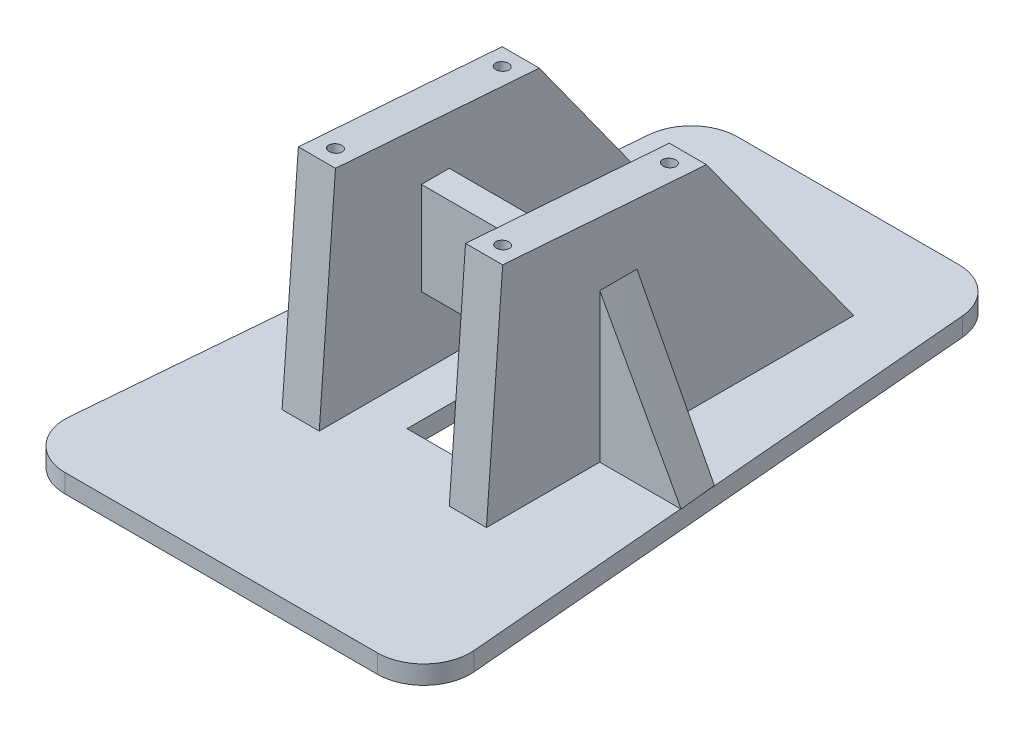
ISO-10303-21;
HEADER;
FILE_DESCRIPTION(('STEP AP214'),'2;1');
FILE_NAME('part.step','',(''),(''),'','','');
FILE_SCHEMA(('AUTOMOTIVE_DESIGN { 1 0 10303 214 1 1 1 1 }'));
ENDSEC;
DATA;
#1=APPLICATION_CONTEXT('core data for automotive mechanical design processes');
#2=APPLICATION_PROTOCOL_DEFINITION('international standard','automotive_design',2000,#1);
#3=PRODUCT_CONTEXT('',#1,'mechanical');
#4=PRODUCT('Part','Part','',(#3));
#5=PRODUCT_RELATED_PRODUCT_CATEGORY('part','',(#4));
#6=PRODUCT_DEFINITION_FORMATION('','',#4);
#7=PRODUCT_DEFINITION_CONTEXT('part definition',#1,'design');
#8=PRODUCT_DEFINITION('design','',#6,#7);
#9=PRODUCT_DEFINITION_SHAPE('','',#8);
#10=(LENGTH_UNIT() NAMED_UNIT(*) SI_UNIT(.MILLI.,.METRE.));
#11=(NAMED_UNIT(*) PLANE_ANGLE_UNIT() SI_UNIT($,.RADIAN.));
#12=(NAMED_UNIT(*) SI_UNIT($,.STERADIAN.) SOLID_ANGLE_UNIT());
#13=UNCERTAINTY_MEASURE_WITH_UNIT(LENGTH_MEASURE(1.E-05),#10,'distance_accuracy_value','');
#14=(GEOMETRIC_REPRESENTATION_CONTEXT(3) GLOBAL_UNCERTAINTY_ASSIGNED_CONTEXT((#13)) GLOBAL_UNIT_ASSIGNED_CONTEXT((#10,
#11,#12)) REPRESENTATION_CONTEXT('',''));
#15=CARTESIAN_POINT('',(0.,0.,0.));
#16=DIRECTION('',(0.,0.,1.));
#17=DIRECTION('',(1.,0.,0.));
#18=AXIS2_PLACEMENT_3D('',#15,#16,#17);
#19=CARTESIAN_POINT('',(0.,4.,0.));
#20=DIRECTION('',(0.,1.,0.));
#21=DIRECTION('',(1.,0.,0.));
#22=AXIS2_PLACEMENT_3D('',#19,#20,#21);
#23=PLANE('',#22);
#24=DIRECTION('',(1.,0.,0.));
#25=VECTOR('',#24,1.);
#26=CARTESIAN_POINT('',(-2.5,4.,-7.5));
#27=LINE('',#26,#25);
#28=CARTESIAN_POINT('',(-5.,4.,-7.5));
#29=VERTEX_POINT('',#28);
#30=CARTESIAN_POINT('',(5.,4.,-7.5));
#31=VERTEX_POINT('',#30);
#32=EDGE_CURVE('E649',#29,#31,#27,.T.);
#33=ORIENTED_EDGE('',*,*,#32,.T.);
#34=DIRECTION('',(0.,0.,1.));
#35=VECTOR('',#34,1.);
#36=CARTESIAN_POINT('',(5.,4.,-3.75));
#37=LINE('',#36,#35);
#38=CARTESIAN_POINT('',(5.,4.,22.5));
#39=VERTEX_POINT('',#38);
#40=EDGE_CURVE('E419',#31,#39,#37,.T.);
#41=ORIENTED_EDGE('',*,*,#40,.T.);
#42=DIRECTION('',(-1.,0.,0.));
#43=VECTOR('',#42,1.);
#44=CARTESIAN_POINT('',(2.5,4.,22.5));
#45=LINE('',#44,#43);
#46=CARTESIAN_POINT('',(-5.,4.,22.5));
#47=VERTEX_POINT('',#46);
#48=EDGE_CURVE('E420',#39,#47,#45,.T.);
#49=ORIENTED_EDGE('',*,*,#48,.T.);
#50=DIRECTION('',(0.,0.,-1.));
#51=VECTOR('',#50,1.);
#52=CARTESIAN_POINT('',(-5.,4.,11.25));
#53=LINE('',#52,#51);
#54=EDGE_CURVE('E408',#47,#29,#53,.T.);
#55=ORIENTED_EDGE('',*,*,#54,.T.);
#56=EDGE_LOOP('',(#33,#41,#49,#55));
#57=FACE_BOUND('',#56,.T.);
#58=DIRECTION('',(0.104587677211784,0.,0.994515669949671));
#59=VECTOR('',#58,1.);
#60=CARTESIAN_POINT('',(38.6776967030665,4.,0.));
#61=LINE('',#60,#59);
#62=CARTESIAN_POINT('',(38.6776967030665,4.,0.));
#63=VERTEX_POINT('',#62);
#64=CARTESIAN_POINT('',(39.0582783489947,4.,3.61891974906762));
#65=VERTEX_POINT('',#64);
#66=EDGE_CURVE('E532',#63,#65,#61,.T.);
#67=ORIENTED_EDGE('',*,*,#66,.T.);
#68=DIRECTION('',(-0.0848777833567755,0.,-0.996391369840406));
#69=VECTOR('',#68,1.);
#70=CARTESIAN_POINT('',(44.5,4.,67.5));
#71=LINE('',#70,#69);
#72=CARTESIAN_POINT('',(33.7795485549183,4.,-58.3487778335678));
#73=VERTEX_POINT('',#72);
#74=EDGE_CURVE('E28',#65,#73,#71,.T.);
#75=ORIENTED_EDGE('',*,*,#74,.T.);
#76=CARTESIAN_POINT('',(23.8156348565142,4.,-57.5));
#77=DIRECTION('',(0.,-1.,0.));
#78=DIRECTION('',(0.676432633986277,0.,-0.736504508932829));
#79=AXIS2_PLACEMENT_3D('',#76,#77,#78);
#80=CIRCLE('',#79,10.);
#81=CARTESIAN_POINT('',(23.8156348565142,4.,-67.5));
#82=VERTEX_POINT('',#81);
#83=EDGE_CURVE('E560',#82,#73,#80,.T.);
#84=ORIENTED_EDGE('',*,*,#83,.F.);
#85=DIRECTION('',(-1.,0.,0.));
#86=VECTOR('',#85,1.);
#87=CARTESIAN_POINT('',(33.,4.,-67.5));
#88=LINE('',#87,#86);
#89=CARTESIAN_POINT('',(-23.8156348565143,4.,-67.5));
#90=VERTEX_POINT('',#89);
#91=EDGE_CURVE('E604',#82,#90,#88,.T.);
#92=ORIENTED_EDGE('',*,*,#91,.T.);
#93=CARTESIAN_POINT('',(-23.8156348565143,4.,-57.5));
#94=DIRECTION('',(0.,-1.,0.));
#95=DIRECTION('',(-0.676432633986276,0.,-0.73650450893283));
#96=AXIS2_PLACEMENT_3D('',#93,#94,#95);
#97=CIRCLE('',#96,10.);
#98=CARTESIAN_POINT('',(-33.7795485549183,4.,-58.3487778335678));
#99=VERTEX_POINT('',#98);
#100=EDGE_CURVE('E449',#99,#90,#97,.T.);
#101=ORIENTED_EDGE('',*,*,#100,.F.);
#102=DIRECTION('',(-0.0848777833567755,0.,0.996391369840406));
#103=VECTOR('',#102,1.);
#104=CARTESIAN_POINT('',(-33.,4.,-67.5));
#105=LINE('',#104,#103);
#106=CARTESIAN_POINT('',(-39.0582783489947,4.,3.61891974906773));
#107=VERTEX_POINT('',#106);
#108=EDGE_CURVE('E544',#99,#107,#105,.T.);
#109=ORIENTED_EDGE('',*,*,#108,.T.);
#110=DIRECTION('',(0.104587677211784,0.,-0.994515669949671));
#111=VECTOR('',#110,1.);
#112=CARTESIAN_POINT('',(-38.6776967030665,4.,0.));
#113=LINE('',#112,#111);
#114=CARTESIAN_POINT('',(-38.6776967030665,4.,0.));
#115=VERTEX_POINT('',#114);
#116=EDGE_CURVE('E557',#107,#115,#113,.T.);
#117=ORIENTED_EDGE('',*,*,#116,.T.);
#118=DIRECTION('',(1.,0.,0.));
#119=VECTOR('',#118,1.);
#120=CARTESIAN_POINT('',(-13.5953688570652,4.,0.));
#121=LINE('',#120,#119);
#122=CARTESIAN_POINT('',(-22.,4.,0.));
#123=VERTEX_POINT('',#122);
#124=EDGE_CURVE('E553',#115,#123,#121,.T.);
#125=ORIENTED_EDGE('',*,*,#124,.T.);
#126=DIRECTION('',(0.,0.,-1.));
#127=VECTOR('',#126,1.);
#128=CARTESIAN_POINT('',(-22.,4.,-7.48785926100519));
#129=LINE('',#128,#127);
#130=CARTESIAN_POINT('',(-22.,4.,-46.6672508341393));
#131=VERTEX_POINT('',#130);
#132=EDGE_CURVE('E425',#123,#131,#129,.T.);
#133=ORIENTED_EDGE('',*,*,#132,.T.);
#134=DIRECTION('',(1.,0.,0.));
#135=VECTOR('',#134,1.);
#136=CARTESIAN_POINT('',(-11.,4.,-46.6672508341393));
#137=LINE('',#136,#135);
#138=CARTESIAN_POINT('',(-14.,4.,-46.6672508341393));
#139=VERTEX_POINT('',#138);
#140=EDGE_CURVE('E736',#131,#139,#137,.T.);
#141=ORIENTED_EDGE('',*,*,#140,.T.);
#142=DIRECTION('',(0.,0.,1.));
#143=VECTOR('',#142,1.);
#144=CARTESIAN_POINT('',(-14.,4.,14.4520313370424));
#145=LINE('',#144,#143);
#146=CARTESIAN_POINT('',(-14.,4.,32.4041094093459));
#147=VERTEX_POINT('',#146);
#148=EDGE_CURVE('E636',#139,#147,#145,.T.);
#149=ORIENTED_EDGE('',*,*,#148,.T.);
#150=DIRECTION('',(-1.,0.,0.));
#151=VECTOR('',#150,1.);
#152=CARTESIAN_POINT('',(-11.,4.,32.4041094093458));
#153=LINE('',#152,#151);
#154=CARTESIAN_POINT('',(-22.,4.,32.4041094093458));
#155=VERTEX_POINT('',#154);
#156=EDGE_CURVE('E421',#147,#155,#153,.T.);
#157=ORIENTED_EDGE('',*,*,#156,.T.);
#158=DIRECTION('',(0.,0.,-1.));
#159=VECTOR('',#158,1.);
#160=CARTESIAN_POINT('',(-22.,4.,-7.48785926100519));
#161=LINE('',#160,#159);
#162=CARTESIAN_POINT('',(-22.,4.,8.));
#163=VERTEX_POINT('',#162);
#164=EDGE_CURVE('E509',#155,#163,#161,.T.);
#165=ORIENTED_EDGE('',*,*,#164,.T.);
#166=DIRECTION('',(-1.,0.,0.));
#167=VECTOR('',#166,1.);
#168=CARTESIAN_POINT('',(-13.7500913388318,4.,8.));
#169=LINE('',#168,#167);
#170=CARTESIAN_POINT('',(-39.4314814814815,4.,8.));
#171=VERTEX_POINT('',#170);
#172=EDGE_CURVE('E402',#163,#171,#169,.T.);
#173=ORIENTED_EDGE('',*,*,#172,.T.);
#174=DIRECTION('',(-0.0848777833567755,0.,0.996391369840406));
#175=VECTOR('',#174,1.);
#176=CARTESIAN_POINT('',(-33.,4.,-67.5));
#177=LINE('',#176,#175);
#178=CARTESIAN_POINT('',(-43.5758448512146,4.,56.6512221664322));
#179=VERTEX_POINT('',#178);
#180=EDGE_CURVE('E289',#171,#179,#177,.T.);
#181=ORIENTED_EDGE('',*,*,#180,.T.);
#182=CARTESIAN_POINT('',(-33.6119311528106,4.,57.5));
#183=DIRECTION('',(0.,-1.,0.));
#184=DIRECTION('',(-0.73650450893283,0.,0.676432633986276));
#185=AXIS2_PLACEMENT_3D('',#182,#183,#184);
#186=CIRCLE('',#185,10.);
#187=CARTESIAN_POINT('',(-33.6119311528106,4.,67.5));
#188=VERTEX_POINT('',#187);
#189=EDGE_CURVE('E411',#188,#179,#186,.T.);
#190=ORIENTED_EDGE('',*,*,#189,.F.);
#191=DIRECTION('',(1.,0.,0.));
#192=VECTOR('',#191,1.);
#193=CARTESIAN_POINT('',(-44.5,4.,67.5));
#194=LINE('',#193,#192);
#195=CARTESIAN_POINT('',(33.6119311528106,4.,67.5));
#196=VERTEX_POINT('',#195);
#197=EDGE_CURVE('E454',#188,#196,#194,.T.);
#198=ORIENTED_EDGE('',*,*,#197,.T.);
#199=CARTESIAN_POINT('',(33.6119311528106,4.,57.5));
#200=DIRECTION('',(0.,-1.,0.));
#201=DIRECTION('',(0.736504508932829,0.,0.676432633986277));
#202=AXIS2_PLACEMENT_3D('',#199,#200,#201);
#203=CIRCLE('',#202,10.);
#204=CARTESIAN_POINT('',(43.5758448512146,4.,56.6512221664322));
#205=VERTEX_POINT('',#204);
#206=EDGE_CURVE('E277',#205,#196,#203,.T.);
#207=ORIENTED_EDGE('',*,*,#206,.F.);
#208=DIRECTION('',(-0.0848777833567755,0.,-0.996391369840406));
#209=VECTOR('',#208,1.);
#210=CARTESIAN_POINT('',(44.5,4.,67.5));
#211=LINE('',#210,#209);
#212=CARTESIAN_POINT('',(39.4314814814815,4.,8.));
#213=VERTEX_POINT('',#212);
#214=EDGE_CURVE('E11',#205,#213,#211,.T.);
#215=ORIENTED_EDGE('',*,*,#214,.T.);
#216=DIRECTION('',(-1.,0.,0.));
#217=VECTOR('',#216,1.);
#218=CARTESIAN_POINT('',(13.7500913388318,4.,8.));
#219=LINE('',#218,#217);
#220=CARTESIAN_POINT('',(22.,4.,8.));
#221=VERTEX_POINT('',#220);
#222=EDGE_CURVE('E536',#213,#221,#219,.T.);
#223=ORIENTED_EDGE('',*,*,#222,.T.);
#224=DIRECTION('',(0.,0.,1.));
#225=VECTOR('',#224,1.);
#226=CARTESIAN_POINT('',(22.,4.,-14.5959223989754));
#227=LINE('',#226,#225);
#228=CARTESIAN_POINT('',(22.,4.,32.4041094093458));
#229=VERTEX_POINT('',#228);
#230=EDGE_CURVE('E379',#221,#229,#227,.T.);
#231=ORIENTED_EDGE('',*,*,#230,.T.);
#232=DIRECTION('',(-1.,0.,0.));
#233=VECTOR('',#232,1.);
#234=CARTESIAN_POINT('',(11.,4.,32.4041094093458));
#235=LINE('',#234,#233);
#236=CARTESIAN_POINT('',(14.,4.,32.4041094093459));
#237=VERTEX_POINT('',#236);
#238=EDGE_CURVE('E370',#229,#237,#235,.T.);
#239=ORIENTED_EDGE('',*,*,#238,.T.);
#240=DIRECTION('',(0.,0.,-1.));
#241=VECTOR('',#240,1.);
#242=CARTESIAN_POINT('',(14.,4.,-14.5959223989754));
#243=LINE('',#242,#241);
#244=CARTESIAN_POINT('',(14.,4.,-46.6672508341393));
#245=VERTEX_POINT('',#244);
#246=EDGE_CURVE('E433',#237,#245,#243,.T.);
#247=ORIENTED_EDGE('',*,*,#246,.T.);
#248=DIRECTION('',(1.,0.,0.));
#249=VECTOR('',#248,1.);
#250=CARTESIAN_POINT('',(11.,4.,-46.6672508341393));
#251=LINE('',#250,#249);
#252=CARTESIAN_POINT('',(22.,4.,-46.6672508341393));
#253=VERTEX_POINT('',#252);
#254=EDGE_CURVE('E460',#245,#253,#251,.T.);
#255=ORIENTED_EDGE('',*,*,#254,.T.);
#256=DIRECTION('',(0.,0.,1.));
#257=VECTOR('',#256,1.);
#258=CARTESIAN_POINT('',(22.,4.,-14.5959223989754));
#259=LINE('',#258,#257);
#260=CARTESIAN_POINT('',(22.,4.,0.));
#261=VERTEX_POINT('',#260);
#262=EDGE_CURVE('E392',#253,#261,#259,.T.);
#263=ORIENTED_EDGE('',*,*,#262,.T.);
#264=DIRECTION('',(1.,0.,0.));
#265=VECTOR('',#264,1.);
#266=CARTESIAN_POINT('',(13.5953688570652,4.,0.));
#267=LINE('',#266,#265);
#268=EDGE_CURVE('E429',#261,#63,#267,.T.);
#269=ORIENTED_EDGE('',*,*,#268,.T.);
#270=EDGE_LOOP('',(#67,#75,#84,#92,#101,#109,#117,#125,#133,#141,#149,#157,#165,#173,#181,#190,
#198,#207,#215,#223,#231,#239,#247,#255,#263,#269));
#271=FACE_BOUND('',#270,.T.);
#272=ADVANCED_FACE('F17',(#57,#271),#23,.T.);
#273=CARTESIAN_POINT('',(44.5,0.,67.5));
#274=DIRECTION('',(0.996391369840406,0.,-0.0848777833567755));
#275=DIRECTION('',(0.,-1.,0.));
#276=AXIS2_PLACEMENT_3D('',#273,#274,#275);
#277=PLANE('',#276);
#278=DIRECTION('',(0.,-1.,0.));
#279=VECTOR('',#278,1.);
#280=CARTESIAN_POINT('',(33.7795485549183,0.,-58.3487778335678));
#281=LINE('',#280,#279);
#282=CARTESIAN_POINT('',(33.7795485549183,0.,-58.3487778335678));
#283=VERTEX_POINT('',#282);
#284=EDGE_CURVE('E541',#73,#283,#281,.T.);
#285=ORIENTED_EDGE('',*,*,#284,.F.);
#286=ORIENTED_EDGE('',*,*,#74,.F.);
#287=DIRECTION('',(-0.0848777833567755,0.,-0.996391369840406));
#288=VECTOR('',#287,1.);
#289=CARTESIAN_POINT('',(44.5,4.,67.5));
#290=LINE('',#289,#288);
#291=EDGE_CURVE('E415',#213,#65,#290,.T.);
#292=ORIENTED_EDGE('',*,*,#291,.F.);
#293=ORIENTED_EDGE('',*,*,#214,.F.);
#294=DIRECTION('',(0.,1.,0.));
#295=VECTOR('',#294,1.);
#296=CARTESIAN_POINT('',(43.5758448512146,0.,56.6512221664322));
#297=LINE('',#296,#295);
#298=CARTESIAN_POINT('',(43.5758448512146,0.,56.6512221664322));
#299=VERTEX_POINT('',#298);
#300=EDGE_CURVE('E540',#299,#205,#297,.T.);
#301=ORIENTED_EDGE('',*,*,#300,.F.);
#302=DIRECTION('',(-0.0848777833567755,0.,-0.996391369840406));
#303=VECTOR('',#302,1.);
#304=CARTESIAN_POINT('',(44.5,0.,67.5));
#305=LINE('',#304,#303);
#306=EDGE_CURVE('E655',#299,#283,#305,.T.);
#307=ORIENTED_EDGE('',*,*,#306,.T.);
#308=EDGE_LOOP('',(#285,#286,#292,#293,#301,#307));
#309=FACE_BOUND('',#308,.T.);
#310=ADVANCED_FACE('F912',(#309),#277,.T.);
#311=CARTESIAN_POINT('',(-33.,0.,-67.5));
#312=DIRECTION('',(-0.996391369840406,0.,-0.0848777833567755));
#313=DIRECTION('',(-0.0848777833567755,0.,0.996391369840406));
#314=AXIS2_PLACEMENT_3D('',#311,#312,#313);
#315=PLANE('',#314);
#316=DIRECTION('',(0.,-1.,0.));
#317=VECTOR('',#316,1.);
#318=CARTESIAN_POINT('',(-43.5758448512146,0.,56.6512221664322));
#319=LINE('',#318,#317);
#320=CARTESIAN_POINT('',(-43.5758448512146,0.,56.6512221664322));
#321=VERTEX_POINT('',#320);
#322=EDGE_CURVE('E704',#179,#321,#319,.T.);
#323=ORIENTED_EDGE('',*,*,#322,.F.);
#324=ORIENTED_EDGE('',*,*,#180,.F.);
#325=DIRECTION('',(-0.0848777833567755,0.,0.996391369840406));
#326=VECTOR('',#325,1.);
#327=CARTESIAN_POINT('',(-33.,4.,-67.5));
#328=LINE('',#327,#326);
#329=EDGE_CURVE('E680',#107,#171,#328,.T.);
#330=ORIENTED_EDGE('',*,*,#329,.F.);
#331=ORIENTED_EDGE('',*,*,#108,.F.);
#332=DIRECTION('',(0.,1.,0.));
#333=VECTOR('',#332,1.);
#334=CARTESIAN_POINT('',(-33.7795485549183,0.,-58.3487778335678));
#335=LINE('',#334,#333);
#336=CARTESIAN_POINT('',(-33.7795485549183,0.,-58.3487778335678));
#337=VERTEX_POINT('',#336);
#338=EDGE_CURVE('E396',#337,#99,#335,.T.);
#339=ORIENTED_EDGE('',*,*,#338,.F.);
#340=DIRECTION('',(-0.0848777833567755,0.,0.996391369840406));
#341=VECTOR('',#340,1.);
#342=CARTESIAN_POINT('',(-33.,0.,-67.5));
#343=LINE('',#342,#341);
#344=EDGE_CURVE('E489',#337,#321,#343,.T.);
#345=ORIENTED_EDGE('',*,*,#344,.T.);
#346=EDGE_LOOP('',(#323,#324,#330,#331,#339,#345));
#347=FACE_BOUND('',#346,.T.);
#348=ADVANCED_FACE('F803',(#347),#315,.T.);
#349=CARTESIAN_POINT('',(33.6119311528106,0.,57.5));
#350=DIRECTION('',(0.,1.,0.));
#351=DIRECTION('',(0.736504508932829,0.,0.676432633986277));
#352=AXIS2_PLACEMENT_3D('',#349,#350,#351);
#353=CYLINDRICAL_SURFACE('',#352,10.);
#354=ORIENTED_EDGE('',*,*,#206,.T.);
#355=DIRECTION('',(0.,-1.,0.));
#356=VECTOR('',#355,1.);
#357=CARTESIAN_POINT('',(33.6119311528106,0.,67.5));
#358=LINE('',#357,#356);
#359=CARTESIAN_POINT('',(33.6119311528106,0.,67.5));
#360=VERTEX_POINT('',#359);
#361=EDGE_CURVE('E497',#196,#360,#358,.T.);
#362=ORIENTED_EDGE('',*,*,#361,.T.);
#363=CARTESIAN_POINT('',(33.6119311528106,0.,57.5));
#364=DIRECTION('',(0.,1.,0.));
#365=DIRECTION('',(0.736504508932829,0.,0.676432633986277));
#366=AXIS2_PLACEMENT_3D('',#363,#364,#365);
#367=CIRCLE('',#366,10.);
#368=EDGE_CURVE('E503',#360,#299,#367,.T.);
#369=ORIENTED_EDGE('',*,*,#368,.T.);
#370=ORIENTED_EDGE('',*,*,#300,.T.);
#371=EDGE_LOOP('',(#354,#362,#369,#370));
#372=FACE_BOUND('',#371,.T.);
#373=ADVANCED_FACE('F913',(#372),#353,.T.);
#374=CARTESIAN_POINT('',(23.8156348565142,0.,-57.5));
#375=DIRECTION('',(0.,1.,0.));
#376=DIRECTION('',(0.676432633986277,0.,-0.736504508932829));
#377=AXIS2_PLACEMENT_3D('',#374,#375,#376);
#378=CYLINDRICAL_SURFACE('',#377,10.);
#379=ORIENTED_EDGE('',*,*,#83,.T.);
#380=ORIENTED_EDGE('',*,*,#284,.T.);
#381=CARTESIAN_POINT('',(23.8156348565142,0.,-57.5));
#382=DIRECTION('',(0.,1.,0.));
#383=DIRECTION('',(0.676432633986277,0.,-0.736504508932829));
#384=AXIS2_PLACEMENT_3D('',#381,#382,#383);
#385=CIRCLE('',#384,10.);
#386=CARTESIAN_POINT('',(23.8156348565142,0.,-67.5));
#387=VERTEX_POINT('',#386);
#388=EDGE_CURVE('E740',#283,#387,#385,.T.);
#389=ORIENTED_EDGE('',*,*,#388,.T.);
#390=DIRECTION('',(0.,1.,0.));
#391=VECTOR('',#390,1.);
#392=CARTESIAN_POINT('',(23.8156348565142,0.,-67.5));
#393=LINE('',#392,#391);
#394=EDGE_CURVE('E600',#387,#82,#393,.T.);
#395=ORIENTED_EDGE('',*,*,#394,.T.);
#396=EDGE_LOOP('',(#379,#380,#389,#395));
#397=FACE_BOUND('',#396,.T.);
#398=ADVANCED_FACE('F910',(#397),#378,.T.);
#399=CARTESIAN_POINT('',(33.,0.,-67.5));
#400=DIRECTION('',(0.,0.,-1.));
#401=DIRECTION('',(0.,-1.,0.));
#402=AXIS2_PLACEMENT_3D('',#399,#400,#401);
#403=PLANE('',#402);
#404=DIRECTION('',(0.,-1.,0.));
#405=VECTOR('',#404,1.);
#406=CARTESIAN_POINT('',(-23.8156348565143,0.,-67.5));
#407=LINE('',#406,#405);
#408=CARTESIAN_POINT('',(-23.8156348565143,0.,-67.5));
#409=VERTEX_POINT('',#408);
#410=EDGE_CURVE('E453',#90,#409,#407,.T.);
#411=ORIENTED_EDGE('',*,*,#410,.F.);
#412=ORIENTED_EDGE('',*,*,#91,.F.);
#413=ORIENTED_EDGE('',*,*,#394,.F.);
#414=DIRECTION('',(-1.,0.,0.));
#415=VECTOR('',#414,1.);
#416=CARTESIAN_POINT('',(33.,0.,-67.5));
#417=LINE('',#416,#415);
#418=EDGE_CURVE('E549',#387,#409,#417,.T.);
#419=ORIENTED_EDGE('',*,*,#418,.T.);
#420=EDGE_LOOP('',(#411,#412,#413,#419));
#421=FACE_BOUND('',#420,.T.);
#422=ADVANCED_FACE('F907',(#421),#403,.T.);
#423=CARTESIAN_POINT('',(-23.8156348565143,0.,-57.5));
#424=DIRECTION('',(0.,1.,0.));
#425=DIRECTION('',(-0.676432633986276,0.,-0.73650450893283));
#426=AXIS2_PLACEMENT_3D('',#423,#424,#425);
#427=CYLINDRICAL_SURFACE('',#426,10.);
#428=ORIENTED_EDGE('',*,*,#100,.T.);
#429=ORIENTED_EDGE('',*,*,#410,.T.);
#430=CARTESIAN_POINT('',(-23.8156348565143,0.,-57.5));
#431=DIRECTION('',(0.,1.,0.));
#432=DIRECTION('',(-0.676432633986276,0.,-0.73650450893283));
#433=AXIS2_PLACEMENT_3D('',#430,#431,#432);
#434=CIRCLE('',#433,10.);
#435=EDGE_CURVE('E545',#409,#337,#434,.T.);
#436=ORIENTED_EDGE('',*,*,#435,.T.);
#437=ORIENTED_EDGE('',*,*,#338,.T.);
#438=EDGE_LOOP('',(#428,#429,#436,#437));
#439=FACE_BOUND('',#438,.T.);
#440=ADVANCED_FACE('F19',(#439),#427,.T.);
#441=CARTESIAN_POINT('',(-44.5,0.,67.5));
#442=DIRECTION('',(0.,0.,1.));
#443=DIRECTION('',(1.,0.,0.));
#444=AXIS2_PLACEMENT_3D('',#441,#442,#443);
#445=PLANE('',#444);
#446=DIRECTION('',(0.,1.,0.));
#447=VECTOR('',#446,1.);
#448=CARTESIAN_POINT('',(-33.6119311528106,0.,67.5));
#449=LINE('',#448,#447);
#450=CARTESIAN_POINT('',(-33.6119311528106,0.,67.5));
#451=VERTEX_POINT('',#450);
#452=EDGE_CURVE('E527',#451,#188,#449,.T.);
#453=ORIENTED_EDGE('',*,*,#452,.F.);
#454=DIRECTION('',(1.,0.,0.));
#455=VECTOR('',#454,1.);
#456=CARTESIAN_POINT('',(-44.5,0.,67.5));
#457=LINE('',#456,#455);
#458=EDGE_CURVE('E498',#451,#360,#457,.T.);
#459=ORIENTED_EDGE('',*,*,#458,.T.);
#460=ORIENTED_EDGE('',*,*,#361,.F.);
#461=ORIENTED_EDGE('',*,*,#197,.F.);
#462=EDGE_LOOP('',(#453,#459,#460,#461));
#463=FACE_BOUND('',#462,.T.);
#464=ADVANCED_FACE('F916',(#463),#445,.T.);
#465=CARTESIAN_POINT('',(-33.6119311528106,0.,57.5));
#466=DIRECTION('',(0.,1.,0.));
#467=DIRECTION('',(-0.73650450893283,0.,0.676432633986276));
#468=AXIS2_PLACEMENT_3D('',#465,#466,#467);
#469=CYLINDRICAL_SURFACE('',#468,10.);
#470=ORIENTED_EDGE('',*,*,#189,.T.);
#471=ORIENTED_EDGE('',*,*,#322,.T.);
#472=CARTESIAN_POINT('',(-33.6119311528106,0.,57.5));
#473=DIRECTION('',(0.,1.,0.));
#474=DIRECTION('',(-0.73650450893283,0.,0.676432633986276));
#475=AXIS2_PLACEMENT_3D('',#472,#473,#474);
#476=CIRCLE('',#475,10.);
#477=EDGE_CURVE('E432',#321,#451,#476,.T.);
#478=ORIENTED_EDGE('',*,*,#477,.T.);
#479=ORIENTED_EDGE('',*,*,#452,.T.);
#480=EDGE_LOOP('',(#470,#471,#478,#479));
#481=FACE_BOUND('',#480,.T.);
#482=ADVANCED_FACE('F799',(#481),#469,.T.);
#483=CARTESIAN_POINT('',(-5.,4.,22.5));
#484=DIRECTION('',(-1.,0.,0.));
#485=DIRECTION('',(0.,1.,0.));
#486=AXIS2_PLACEMENT_3D('',#483,#484,#485);
#487=PLANE('',#486);
#488=DIRECTION('',(0.,0.,1.));
#489=VECTOR('',#488,1.);
#490=CARTESIAN_POINT('',(-5.,0.,11.25));
#491=LINE('',#490,#489);
#492=CARTESIAN_POINT('',(-5.,0.,-7.5));
#493=VERTEX_POINT('',#492);
#494=CARTESIAN_POINT('',(-5.,0.,22.5));
#495=VERTEX_POINT('',#494);
#496=EDGE_CURVE('E620',#493,#495,#491,.T.);
#497=ORIENTED_EDGE('',*,*,#496,.F.);
#498=DIRECTION('',(0.,-1.,0.));
#499=VECTOR('',#498,1.);
#500=CARTESIAN_POINT('',(-5.,4.,-7.5));
#501=LINE('',#500,#499);
#502=EDGE_CURVE('E412',#29,#493,#501,.T.);
#503=ORIENTED_EDGE('',*,*,#502,.F.);
#504=ORIENTED_EDGE('',*,*,#54,.F.);
#505=DIRECTION('',(0.,-1.,0.));
#506=VECTOR('',#505,1.);
#507=CARTESIAN_POINT('',(-5.,4.,22.5));
#508=LINE('',#507,#506);
#509=EDGE_CURVE('E579',#47,#495,#508,.T.);
#510=ORIENTED_EDGE('',*,*,#509,.T.);
#511=EDGE_LOOP('',(#497,#503,#504,#510));
#512=FACE_BOUND('',#511,.T.);
#513=ADVANCED_FACE('F777',(#512),#487,.F.);
#514=CARTESIAN_POINT('',(-5.,4.,-7.5));
#515=DIRECTION('',(0.,0.,-1.));
#516=DIRECTION('',(-1.,0.,0.));
#517=AXIS2_PLACEMENT_3D('',#514,#515,#516);
#518=PLANE('',#517);
#519=DIRECTION('',(-1.,0.,0.));
#520=VECTOR('',#519,1.);
#521=CARTESIAN_POINT('',(-2.5,0.,-7.5));
#522=LINE('',#521,#520);
#523=CARTESIAN_POINT('',(5.,0.,-7.5));
#524=VERTEX_POINT('',#523);
#525=EDGE_CURVE('E502',#524,#493,#522,.T.);
#526=ORIENTED_EDGE('',*,*,#525,.F.);
#527=DIRECTION('',(0.,-1.,0.));
#528=VECTOR('',#527,1.);
#529=CARTESIAN_POINT('',(5.,4.,-7.5));
#530=LINE('',#529,#528);
#531=EDGE_CURVE('E21',#31,#524,#530,.T.);
#532=ORIENTED_EDGE('',*,*,#531,.F.);
#533=ORIENTED_EDGE('',*,*,#32,.F.);
#534=ORIENTED_EDGE('',*,*,#502,.T.);
#535=EDGE_LOOP('',(#526,#532,#533,#534));
#536=FACE_BOUND('',#535,.T.);
#537=ADVANCED_FACE('F782',(#536),#518,.F.);
#538=CARTESIAN_POINT('',(5.,4.,-7.5));
#539=DIRECTION('',(1.,0.,0.));
#540=DIRECTION('',(0.,0.,-1.));
#541=AXIS2_PLACEMENT_3D('',#538,#539,#540);
#542=PLANE('',#541);
#543=DIRECTION('',(0.,0.,-1.));
#544=VECTOR('',#543,1.);
#545=CARTESIAN_POINT('',(5.,0.,-3.75));
#546=LINE('',#545,#544);
#547=CARTESIAN_POINT('',(5.,0.,22.5));
#548=VERTEX_POINT('',#547);
#549=EDGE_CURVE('E575',#548,#524,#546,.T.);
#550=ORIENTED_EDGE('',*,*,#549,.F.);
#551=DIRECTION('',(0.,-1.,0.));
#552=VECTOR('',#551,1.);
#553=CARTESIAN_POINT('',(5.,4.,22.5));
#554=LINE('',#553,#552);
#555=EDGE_CURVE('E416',#39,#548,#554,.T.);
#556=ORIENTED_EDGE('',*,*,#555,.F.);
#557=ORIENTED_EDGE('',*,*,#40,.F.);
#558=ORIENTED_EDGE('',*,*,#531,.T.);
#559=EDGE_LOOP('',(#550,#556,#557,#558));
#560=FACE_BOUND('',#559,.T.);
#561=ADVANCED_FACE('F785',(#560),#542,.F.);
#562=CARTESIAN_POINT('',(5.,4.,22.5));
#563=DIRECTION('',(0.,0.,1.));
#564=DIRECTION('',(1.,0.,0.));
#565=AXIS2_PLACEMENT_3D('',#562,#563,#564);
#566=PLANE('',#565);
#567=DIRECTION('',(1.,0.,0.));
#568=VECTOR('',#567,1.);
#569=CARTESIAN_POINT('',(2.5,0.,22.5));
#570=LINE('',#569,#568);
#571=EDGE_CURVE('E580',#495,#548,#570,.T.);
#572=ORIENTED_EDGE('',*,*,#571,.F.);
#573=ORIENTED_EDGE('',*,*,#509,.F.);
#574=ORIENTED_EDGE('',*,*,#48,.F.);
#575=ORIENTED_EDGE('',*,*,#555,.T.);
#576=EDGE_LOOP('',(#572,#573,#574,#575));
#577=FACE_BOUND('',#576,.T.);
#578=ADVANCED_FACE('F774',(#577),#566,.F.);
#579=CARTESIAN_POINT('',(0.,0.,0.));
#580=DIRECTION('',(0.,1.,0.));
#581=DIRECTION('',(1.,0.,0.));
#582=AXIS2_PLACEMENT_3D('',#579,#580,#581);
#583=PLANE('',#582);
#584=ORIENTED_EDGE('',*,*,#525,.T.);
#585=ORIENTED_EDGE('',*,*,#496,.T.);
#586=ORIENTED_EDGE('',*,*,#571,.T.);
#587=ORIENTED_EDGE('',*,*,#549,.T.);
#588=EDGE_LOOP('',(#584,#585,#586,#587));
#589=FACE_BOUND('',#588,.T.);
#590=ORIENTED_EDGE('',*,*,#477,.F.);
#591=ORIENTED_EDGE('',*,*,#344,.F.);
#592=ORIENTED_EDGE('',*,*,#435,.F.);
#593=ORIENTED_EDGE('',*,*,#418,.F.);
#594=ORIENTED_EDGE('',*,*,#388,.F.);
#595=ORIENTED_EDGE('',*,*,#306,.F.);
#596=ORIENTED_EDGE('',*,*,#368,.F.);
#597=ORIENTED_EDGE('',*,*,#458,.F.);
#598=EDGE_LOOP('',(#590,#591,#592,#593,#594,#595,#596,#597));
#599=FACE_BOUND('',#598,.T.);
#600=ADVANCED_FACE('F787',(#589,#599),#583,.F.);
#601=CARTESIAN_POINT('',(18.,49.6254538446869,6.96417207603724));
#602=DIRECTION('',(0.,0.997267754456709,-0.0738716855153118));
#603=DIRECTION('',(-1.,0.,0.));
#604=AXIS2_PLACEMENT_3D('',#601,#602,#603);
#605=PLANE('',#604);
#606=CARTESIAN_POINT('',(18.,48.2957635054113,-10.9866475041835));
#607=DIRECTION('',(0.,-0.997267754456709,0.0738716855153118));
#608=DIRECTION('',(1.,0.,0.));
#609=AXIS2_PLACEMENT_3D('',#606,#607,#608);
#610=CIRCLE('',#609,1.375);
#611=CARTESIAN_POINT('',(19.375,48.2957635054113,-10.9866475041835));
#612=VERTEX_POINT('',#611);
#613=CARTESIAN_POINT('',(16.625,48.2957635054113,-10.9866475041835));
#614=VERTEX_POINT('',#613);
#615=EDGE_CURVE('E494',#612,#614,#610,.T.);
#616=ORIENTED_EDGE('',*,*,#615,.T.);
#617=CARTESIAN_POINT('',(18.,48.2957635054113,-10.9866475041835));
#618=DIRECTION('',(0.,-0.997267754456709,0.0738716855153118));
#619=DIRECTION('',(1.,0.,0.));
#620=AXIS2_PLACEMENT_3D('',#617,#618,#619);
#621=CIRCLE('',#620,1.375);
#622=EDGE_CURVE('E490',#614,#612,#621,.T.);
#623=ORIENTED_EDGE('',*,*,#622,.T.);
#624=EDGE_LOOP('',(#616,#623));
#625=FACE_BOUND('',#624,.T.);
#626=CARTESIAN_POINT('',(18.,50.9551441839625,24.914991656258));
#627=DIRECTION('',(0.,-0.997267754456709,0.0738716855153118));
#628=DIRECTION('',(1.,0.,0.));
#629=AXIS2_PLACEMENT_3D('',#626,#627,#628);
#630=CIRCLE('',#629,1.375);
#631=CARTESIAN_POINT('',(19.375,50.9551441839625,24.914991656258));
#632=VERTEX_POINT('',#631);
#633=CARTESIAN_POINT('',(16.625,50.9551441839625,24.914991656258));
#634=VERTEX_POINT('',#633);
#635=EDGE_CURVE('E469',#632,#634,#630,.T.);
#636=ORIENTED_EDGE('',*,*,#635,.T.);
#637=CARTESIAN_POINT('',(18.,50.9551441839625,24.914991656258));
#638=DIRECTION('',(0.,-0.997267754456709,0.0738716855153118));
#639=DIRECTION('',(1.,0.,0.));
#640=AXIS2_PLACEMENT_3D('',#637,#638,#639);
#641=CIRCLE('',#640,1.375);
#642=EDGE_CURVE('E521',#634,#632,#641,.T.);
#643=ORIENTED_EDGE('',*,*,#642,.T.);
#644=EDGE_LOOP('',(#636,#643));
#645=FACE_BOUND('',#644,.T.);
#646=DIRECTION('',(0.,-0.0738716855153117,-0.997267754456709));
#647=VECTOR('',#646,1.);
#648=CARTESIAN_POINT('',(22.,51.2506309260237,28.9040626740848));
#649=LINE('',#648,#647);
#650=CARTESIAN_POINT('',(22.,51.2506309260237,28.9040626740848));
#651=VERTEX_POINT('',#650);
#652=CARTESIAN_POINT('',(22.,48.00027676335,-14.9757185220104));
#653=VERTEX_POINT('',#652);
#654=EDGE_CURVE('E362',#651,#653,#649,.T.);
#655=ORIENTED_EDGE('',*,*,#654,.T.);
#656=DIRECTION('',(-1.,0.,0.));
#657=VECTOR('',#656,1.);
#658=CARTESIAN_POINT('',(22.,48.00027676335,-14.9757185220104));
#659=LINE('',#658,#657);
#660=CARTESIAN_POINT('',(14.,48.00027676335,-14.9757185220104));
#661=VERTEX_POINT('',#660);
#662=EDGE_CURVE('E478',#653,#661,#659,.T.);
#663=ORIENTED_EDGE('',*,*,#662,.T.);
#664=DIRECTION('',(0.,0.0738716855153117,0.997267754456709));
#665=VECTOR('',#664,1.);
#666=CARTESIAN_POINT('',(14.,48.00027676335,-14.9757185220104));
#667=LINE('',#666,#665);
#668=CARTESIAN_POINT('',(14.,51.2506309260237,28.9040626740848));
#669=VERTEX_POINT('',#668);
#670=EDGE_CURVE('E364',#661,#669,#667,.T.);
#671=ORIENTED_EDGE('',*,*,#670,.T.);
#672=DIRECTION('',(1.,0.,0.));
#673=VECTOR('',#672,1.);
#674=CARTESIAN_POINT('',(14.,51.2506309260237,28.9040626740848));
#675=LINE('',#674,#673);
#676=EDGE_CURVE('E357',#669,#651,#675,.T.);
#677=ORIENTED_EDGE('',*,*,#676,.T.);
#678=EDGE_LOOP('',(#655,#663,#671,#677));
#679=FACE_BOUND('',#678,.T.);
#680=ADVANCED_FACE('F359',(#625,#645,#679),#605,.T.);
#681=CARTESIAN_POINT('',(14.,51.2506309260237,28.9040626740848));
#682=DIRECTION('',(-1.,0.,0.));
#683=DIRECTION('',(0.,1.,0.));
#684=AXIS2_PLACEMENT_3D('',#681,#682,#683);
#685=PLANE('',#684);
#686=DIRECTION('',(0.,1.,0.));
#687=VECTOR('',#686,1.);
#688=CARTESIAN_POINT('',(14.,45.1253154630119,4.40410940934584));
#689=LINE('',#688,#687);
#690=CARTESIAN_POINT('',(14.,19.,4.40410940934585));
#691=VERTEX_POINT('',#690);
#692=CARTESIAN_POINT('',(14.,39.,4.40410940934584));
#693=VERTEX_POINT('',#692);
#694=EDGE_CURVE('E464',#691,#693,#689,.T.);
#695=ORIENTED_EDGE('',*,*,#694,.T.);
#696=DIRECTION('',(0.,0.,1.));
#697=VECTOR('',#696,1.);
#698=CARTESIAN_POINT('',(14.,39.,19.6540860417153));
#699=LINE('',#698,#697);
#700=CARTESIAN_POINT('',(14.,39.,10.4041094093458));
#701=VERTEX_POINT('',#700);
#702=EDGE_CURVE('E513',#693,#701,#699,.T.);
#703=ORIENTED_EDGE('',*,*,#702,.T.);
#704=DIRECTION('',(0.,-1.,0.));
#705=VECTOR('',#704,1.);
#706=CARTESIAN_POINT('',(14.,35.1253154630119,10.4041094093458));
#707=LINE('',#706,#705);
#708=CARTESIAN_POINT('',(14.,19.,10.4041094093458));
#709=VERTEX_POINT('',#708);
#710=EDGE_CURVE('E443',#701,#709,#707,.T.);
#711=ORIENTED_EDGE('',*,*,#710,.T.);
#712=DIRECTION('',(0.,0.,-1.));
#713=VECTOR('',#712,1.);
#714=CARTESIAN_POINT('',(14.,19.,16.6540860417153));
#715=LINE('',#714,#713);
#716=EDGE_CURVE('E592',#709,#691,#715,.T.);
#717=ORIENTED_EDGE('',*,*,#716,.T.);
#718=EDGE_LOOP('',(#695,#703,#711,#717));
#719=FACE_BOUND('',#718,.T.);
#720=ORIENTED_EDGE('',*,*,#246,.F.);
#721=DIRECTION('',(0.,-0.997267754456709,0.0738716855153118));
#722=VECTOR('',#721,1.);
#723=CARTESIAN_POINT('',(14.,51.2506309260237,28.9040626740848));
#724=LINE('',#723,#722);
#725=EDGE_CURVE('E369',#669,#237,#724,.T.);
#726=ORIENTED_EDGE('',*,*,#725,.F.);
#727=ORIENTED_EDGE('',*,*,#670,.F.);
#728=DIRECTION('',(0.,0.811435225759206,0.584442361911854));
#729=VECTOR('',#728,1.);
#730=CARTESIAN_POINT('',(14.,37.3866254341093,-22.6202812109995));
#731=LINE('',#730,#729);
#732=EDGE_CURVE('E481',#245,#661,#731,.T.);
#733=ORIENTED_EDGE('',*,*,#732,.F.);
#734=EDGE_LOOP('',(#720,#726,#727,#733));
#735=FACE_BOUND('',#734,.T.);
#736=ADVANCED_FACE('F927',(#719,#735),#685,.T.);
#737=CARTESIAN_POINT('',(22.,51.2506309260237,28.9040626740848));
#738=DIRECTION('',(0.,0.0738716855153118,0.997267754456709));
#739=DIRECTION('',(1.,0.,0.));
#740=AXIS2_PLACEMENT_3D('',#737,#738,#739);
#741=PLANE('',#740);
#742=ORIENTED_EDGE('',*,*,#238,.F.);
#743=DIRECTION('',(0.,-0.997267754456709,0.0738716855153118));
#744=VECTOR('',#743,1.);
#745=CARTESIAN_POINT('',(22.,51.2506309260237,28.9040626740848));
#746=LINE('',#745,#744);
#747=EDGE_CURVE('E373',#651,#229,#746,.T.);
#748=ORIENTED_EDGE('',*,*,#747,.F.);
#749=ORIENTED_EDGE('',*,*,#676,.F.);
#750=ORIENTED_EDGE('',*,*,#725,.T.);
#751=EDGE_LOOP('',(#742,#748,#749,#750));
#752=FACE_BOUND('',#751,.T.);
#753=ADVANCED_FACE('F374',(#752),#741,.T.);
#754=CARTESIAN_POINT('',(-18.,49.6254538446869,6.96417207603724));
#755=DIRECTION('',(0.,-0.997267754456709,0.0738716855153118));
#756=DIRECTION('',(-1.,0.,0.));
#757=AXIS2_PLACEMENT_3D('',#754,#755,#756);
#758=PLANE('',#757);
#759=CARTESIAN_POINT('',(-18.,48.2957635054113,-10.9866475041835));
#760=DIRECTION('',(0.,-0.997267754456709,0.0738716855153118));
#761=DIRECTION('',(1.,0.,0.));
#762=AXIS2_PLACEMENT_3D('',#759,#760,#761);
#763=CIRCLE('',#762,1.375);
#764=CARTESIAN_POINT('',(-16.625,48.2957635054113,-10.9866475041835));
#765=VERTEX_POINT('',#764);
#766=CARTESIAN_POINT('',(-19.375,48.2957635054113,-10.9866475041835));
#767=VERTEX_POINT('',#766);
#768=EDGE_CURVE('E607',#765,#767,#763,.T.);
#769=ORIENTED_EDGE('',*,*,#768,.T.);
#770=CARTESIAN_POINT('',(-18.,48.2957635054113,-10.9866475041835));
#771=DIRECTION('',(0.,-0.997267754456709,0.0738716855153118));
#772=DIRECTION('',(1.,0.,0.));
#773=AXIS2_PLACEMENT_3D('',#770,#771,#772);
#774=CIRCLE('',#773,1.375);
#775=EDGE_CURVE('E442',#767,#765,#774,.T.);
#776=ORIENTED_EDGE('',*,*,#775,.T.);
#777=EDGE_LOOP('',(#769,#776));
#778=FACE_BOUND('',#777,.T.);
#779=CARTESIAN_POINT('',(-18.,50.9551441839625,24.914991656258));
#780=DIRECTION('',(0.,-0.997267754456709,0.0738716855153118));
#781=DIRECTION('',(1.,0.,0.));
#782=AXIS2_PLACEMENT_3D('',#779,#780,#781);
#783=CIRCLE('',#782,1.375);
#784=CARTESIAN_POINT('',(-16.625,50.9551441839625,24.914991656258));
#785=VERTEX_POINT('',#784);
#786=CARTESIAN_POINT('',(-19.375,50.9551441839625,24.914991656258));
#787=VERTEX_POINT('',#786);
#788=EDGE_CURVE('E455',#785,#787,#783,.T.);
#789=ORIENTED_EDGE('',*,*,#788,.T.);
#790=CARTESIAN_POINT('',(-18.,50.9551441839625,24.914991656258));
#791=DIRECTION('',(0.,-0.997267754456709,0.0738716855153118));
#792=DIRECTION('',(1.,0.,0.));
#793=AXIS2_PLACEMENT_3D('',#790,#791,#792);
#794=CIRCLE('',#793,1.375);
#795=EDGE_CURVE('E459',#787,#785,#794,.T.);
#796=ORIENTED_EDGE('',*,*,#795,.T.);
#797=EDGE_LOOP('',(#789,#796));
#798=FACE_BOUND('',#797,.T.);
#799=DIRECTION('',(0.,-0.0738716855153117,-0.997267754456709));
#800=VECTOR('',#799,1.);
#801=CARTESIAN_POINT('',(-22.,51.2506309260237,28.9040626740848));
#802=LINE('',#801,#800);
#803=CARTESIAN_POINT('',(-22.,51.2506309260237,28.9040626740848));
#804=VERTEX_POINT('',#803);
#805=CARTESIAN_POINT('',(-22.,48.00027676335,-14.9757185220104));
#806=VERTEX_POINT('',#805);
#807=EDGE_CURVE('E508',#804,#806,#802,.T.);
#808=ORIENTED_EDGE('',*,*,#807,.F.);
#809=DIRECTION('',(-1.,0.,0.));
#810=VECTOR('',#809,1.);
#811=CARTESIAN_POINT('',(-14.,51.2506309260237,28.9040626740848));
#812=LINE('',#811,#810);
#813=CARTESIAN_POINT('',(-14.,51.2506309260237,28.9040626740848));
#814=VERTEX_POINT('',#813);
#815=EDGE_CURVE('E477',#814,#804,#812,.T.);
#816=ORIENTED_EDGE('',*,*,#815,.F.);
#817=DIRECTION('',(0.,0.0738716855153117,0.997267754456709));
#818=VECTOR('',#817,1.);
#819=CARTESIAN_POINT('',(-14.,48.00027676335,-14.9757185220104));
#820=LINE('',#819,#818);
#821=CARTESIAN_POINT('',(-14.,48.00027676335,-14.9757185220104));
#822=VERTEX_POINT('',#821);
#823=EDGE_CURVE('E473',#822,#814,#820,.T.);
#824=ORIENTED_EDGE('',*,*,#823,.F.);
#825=DIRECTION('',(1.,0.,0.));
#826=VECTOR('',#825,1.);
#827=CARTESIAN_POINT('',(-22.,48.00027676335,-14.9757185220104));
#828=LINE('',#827,#826);
#829=EDGE_CURVE('E564',#806,#822,#828,.T.);
#830=ORIENTED_EDGE('',*,*,#829,.F.);
#831=EDGE_LOOP('',(#808,#816,#824,#830));
#832=FACE_BOUND('',#831,.T.);
#833=ADVANCED_FACE('F934',(#778,#798,#832),#758,.F.);
#834=CARTESIAN_POINT('',(-14.,51.2506309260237,28.9040626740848));
#835=DIRECTION('',(-1.,0.,0.));
#836=DIRECTION('',(0.,0.,1.));
#837=AXIS2_PLACEMENT_3D('',#834,#835,#836);
#838=PLANE('',#837);
#839=DIRECTION('',(0.,-1.,0.));
#840=VECTOR('',#839,1.);
#841=CARTESIAN_POINT('',(-14.,45.1253154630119,4.40410940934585));
#842=LINE('',#841,#840);
#843=CARTESIAN_POINT('',(-14.,39.,4.40410940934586));
#844=VERTEX_POINT('',#843);
#845=CARTESIAN_POINT('',(-14.,19.,4.40410940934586));
#846=VERTEX_POINT('',#845);
#847=EDGE_CURVE('E461',#844,#846,#842,.T.);
#848=ORIENTED_EDGE('',*,*,#847,.T.);
#849=DIRECTION('',(0.,0.,1.));
#850=VECTOR('',#849,1.);
#851=CARTESIAN_POINT('',(-14.,19.,16.6540860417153));
#852=LINE('',#851,#850);
#853=CARTESIAN_POINT('',(-14.,19.,10.4041094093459));
#854=VERTEX_POINT('',#853);
#855=EDGE_CURVE('E630',#846,#854,#852,.T.);
#856=ORIENTED_EDGE('',*,*,#855,.T.);
#857=DIRECTION('',(0.,1.,0.));
#858=VECTOR('',#857,1.);
#859=CARTESIAN_POINT('',(-14.,35.1253154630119,10.4041094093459));
#860=LINE('',#859,#858);
#861=CARTESIAN_POINT('',(-14.,39.,10.4041094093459));
#862=VERTEX_POINT('',#861);
#863=EDGE_CURVE('E570',#854,#862,#860,.T.);
#864=ORIENTED_EDGE('',*,*,#863,.T.);
#865=DIRECTION('',(0.,0.,-1.));
#866=VECTOR('',#865,1.);
#867=CARTESIAN_POINT('',(-14.,39.,19.6540860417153));
#868=LINE('',#867,#866);
#869=EDGE_CURVE('E588',#862,#844,#868,.T.);
#870=ORIENTED_EDGE('',*,*,#869,.T.);
#871=EDGE_LOOP('',(#848,#856,#864,#870));
#872=FACE_BOUND('',#871,.T.);
#873=ORIENTED_EDGE('',*,*,#148,.F.);
#874=DIRECTION('',(0.,0.811435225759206,0.584442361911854));
#875=VECTOR('',#874,1.);
#876=CARTESIAN_POINT('',(-14.,37.3866254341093,-22.6202812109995));
#877=LINE('',#876,#875);
#878=EDGE_CURVE('E731',#139,#822,#877,.T.);
#879=ORIENTED_EDGE('',*,*,#878,.T.);
#880=ORIENTED_EDGE('',*,*,#823,.T.);
#881=DIRECTION('',(0.,-0.997267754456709,0.0738716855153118));
#882=VECTOR('',#881,1.);
#883=CARTESIAN_POINT('',(-14.,51.2506309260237,28.9040626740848));
#884=LINE('',#883,#882);
#885=EDGE_CURVE('E424',#814,#147,#884,.T.);
#886=ORIENTED_EDGE('',*,*,#885,.T.);
#887=EDGE_LOOP('',(#873,#879,#880,#886));
#888=FACE_BOUND('',#887,.T.);
#889=ADVANCED_FACE('F970',(#872,#888),#838,.F.);
#890=CARTESIAN_POINT('',(-22.,51.2506309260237,28.9040626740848));
#891=DIRECTION('',(0.,-0.0738716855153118,-0.997267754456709));
#892=DIRECTION('',(0.,-0.997267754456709,0.0738716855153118));
#893=AXIS2_PLACEMENT_3D('',#890,#891,#892);
#894=PLANE('',#893);
#895=ORIENTED_EDGE('',*,*,#156,.F.);
#896=ORIENTED_EDGE('',*,*,#885,.F.);
#897=ORIENTED_EDGE('',*,*,#815,.T.);
#898=DIRECTION('',(0.,-0.997267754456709,0.0738716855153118));
#899=VECTOR('',#898,1.);
#900=CARTESIAN_POINT('',(-22.,51.2506309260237,28.9040626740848));
#901=LINE('',#900,#899);
#902=EDGE_CURVE('E504',#804,#155,#901,.T.);
#903=ORIENTED_EDGE('',*,*,#902,.T.);
#904=EDGE_LOOP('',(#895,#896,#897,#903));
#905=FACE_BOUND('',#904,.T.);
#906=ADVANCED_FACE('F1030',(#905),#894,.F.);
#907=CARTESIAN_POINT('',(-22.,48.00027676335,-14.9757185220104));
#908=DIRECTION('',(1.,0.,0.));
#909=DIRECTION('',(0.,0.,1.));
#910=AXIS2_PLACEMENT_3D('',#907,#908,#909);
#911=PLANE('',#910);
#912=DIRECTION('',(0.,-1.,0.));
#913=VECTOR('',#912,1.);
#914=CARTESIAN_POINT('',(-22.,32.370476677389,8.));
#915=LINE('',#914,#913);
#916=CARTESIAN_POINT('',(-22.,36.,8.));
#917=VERTEX_POINT('',#916);
#918=EDGE_CURVE('E398',#917,#163,#915,.T.);
#919=ORIENTED_EDGE('',*,*,#918,.T.);
#920=ORIENTED_EDGE('',*,*,#164,.F.);
#921=ORIENTED_EDGE('',*,*,#902,.F.);
#922=ORIENTED_EDGE('',*,*,#807,.T.);
#923=DIRECTION('',(0.,0.811435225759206,0.584442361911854));
#924=VECTOR('',#923,1.);
#925=CARTESIAN_POINT('',(-22.,4.,-46.6672508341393));
#926=LINE('',#925,#924);
#927=EDGE_CURVE('E733',#131,#806,#926,.T.);
#928=ORIENTED_EDGE('',*,*,#927,.F.);
#929=ORIENTED_EDGE('',*,*,#132,.F.);
#930=DIRECTION('',(0.,1.,0.));
#931=VECTOR('',#930,1.);
#932=CARTESIAN_POINT('',(-22.,32.4260830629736,0.));
#933=LINE('',#932,#931);
#934=CARTESIAN_POINT('',(-22.,36.,0.));
#935=VERTEX_POINT('',#934);
#936=EDGE_CURVE('E525',#123,#935,#933,.T.);
#937=ORIENTED_EDGE('',*,*,#936,.T.);
#938=DIRECTION('',(0.,0.,1.));
#939=VECTOR('',#938,1.);
#940=CARTESIAN_POINT('',(-22.,36.,0.));
#941=LINE('',#940,#939);
#942=EDGE_CURVE('E677',#935,#917,#941,.T.);
#943=ORIENTED_EDGE('',*,*,#942,.T.);
#944=EDGE_LOOP('',(#919,#920,#921,#922,#928,#929,#937,#943));
#945=FACE_BOUND('',#944,.T.);
#946=ADVANCED_FACE('F892',(#945),#911,.F.);
#947=CARTESIAN_POINT('',(14.,39.,4.40410940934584));
#948=DIRECTION('',(0.,0.,-1.));
#949=DIRECTION('',(-1.,0.,0.));
#950=AXIS2_PLACEMENT_3D('',#947,#948,#949);
#951=PLANE('',#950);
#952=ORIENTED_EDGE('',*,*,#847,.F.);
#953=DIRECTION('',(-1.,0.,0.));
#954=VECTOR('',#953,1.);
#955=CARTESIAN_POINT('',(14.,39.,4.40410940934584));
#956=LINE('',#955,#954);
#957=EDGE_CURVE('E465',#693,#844,#956,.T.);
#958=ORIENTED_EDGE('',*,*,#957,.F.);
#959=ORIENTED_EDGE('',*,*,#694,.F.);
#960=DIRECTION('',(-1.,0.,0.));
#961=VECTOR('',#960,1.);
#962=CARTESIAN_POINT('',(14.,19.,4.40410940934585));
#963=LINE('',#962,#961);
#964=EDGE_CURVE('E639',#691,#846,#963,.T.);
#965=ORIENTED_EDGE('',*,*,#964,.T.);
#966=EDGE_LOOP('',(#952,#958,#959,#965));
#967=FACE_BOUND('',#966,.T.);
#968=ADVANCED_FACE('F992',(#967),#951,.T.);
#969=CARTESIAN_POINT('',(14.,39.,10.4041094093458));
#970=DIRECTION('',(0.,1.,0.));
#971=DIRECTION('',(1.,0.,0.));
#972=AXIS2_PLACEMENT_3D('',#969,#970,#971);
#973=PLANE('',#972);
#974=ORIENTED_EDGE('',*,*,#869,.F.);
#975=DIRECTION('',(-1.,0.,0.));
#976=VECTOR('',#975,1.);
#977=CARTESIAN_POINT('',(14.,39.,10.4041094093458));
#978=LINE('',#977,#976);
#979=EDGE_CURVE('E447',#701,#862,#978,.T.);
#980=ORIENTED_EDGE('',*,*,#979,.F.);
#981=ORIENTED_EDGE('',*,*,#702,.F.);
#982=ORIENTED_EDGE('',*,*,#957,.T.);
#983=EDGE_LOOP('',(#974,#980,#981,#982));
#984=FACE_BOUND('',#983,.T.);
#985=ADVANCED_FACE('F976',(#984),#973,.T.);
#986=CARTESIAN_POINT('',(14.,19.,4.40410940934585));
#987=DIRECTION('',(0.,-1.,0.));
#988=DIRECTION('',(-1.,0.,0.));
#989=AXIS2_PLACEMENT_3D('',#986,#987,#988);
#990=PLANE('',#989);
#991=ORIENTED_EDGE('',*,*,#855,.F.);
#992=ORIENTED_EDGE('',*,*,#964,.F.);
#993=ORIENTED_EDGE('',*,*,#716,.F.);
#994=DIRECTION('',(-1.,0.,0.));
#995=VECTOR('',#994,1.);
#996=CARTESIAN_POINT('',(14.,19.,10.4041094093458));
#997=LINE('',#996,#995);
#998=EDGE_CURVE('E448',#709,#854,#997,.T.);
#999=ORIENTED_EDGE('',*,*,#998,.T.);
#1000=EDGE_LOOP('',(#991,#992,#993,#999));
#1001=FACE_BOUND('',#1000,.T.);
#1002=ADVANCED_FACE('F972',(#1001),#990,.T.);
#1003=CARTESIAN_POINT('',(14.,19.,10.4041094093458));
#1004=DIRECTION('',(0.,0.,1.));
#1005=DIRECTION('',(1.,0.,0.));
#1006=AXIS2_PLACEMENT_3D('',#1003,#1004,#1005);
#1007=PLANE('',#1006);
#1008=ORIENTED_EDGE('',*,*,#863,.F.);
#1009=ORIENTED_EDGE('',*,*,#998,.F.);
#1010=ORIENTED_EDGE('',*,*,#710,.F.);
#1011=ORIENTED_EDGE('',*,*,#979,.T.);
#1012=EDGE_LOOP('',(#1008,#1009,#1010,#1011));
#1013=FACE_BOUND('',#1012,.T.);
#1014=ADVANCED_FACE('F975',(#1013),#1007,.T.);
#1015=CARTESIAN_POINT('',(18.,38.3230859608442,-10.2479306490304));
#1016=DIRECTION('',(0.,0.997267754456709,-0.0738716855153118));
#1017=DIRECTION('',(-1.,0.,0.));
#1018=AXIS2_PLACEMENT_3D('',#1015,#1016,#1017);
#1019=PLANE('',#1018);
#1020=CARTESIAN_POINT('',(18.,38.3230859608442,-10.2479306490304));
#1021=DIRECTION('',(0.,-0.997267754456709,0.0738716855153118));
#1022=DIRECTION('',(1.,0.,0.));
#1023=AXIS2_PLACEMENT_3D('',#1020,#1021,#1022);
#1024=CIRCLE('',#1023,1.375);
#1025=CARTESIAN_POINT('',(19.375,38.3230859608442,-10.2479306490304));
#1026=VERTEX_POINT('',#1025);
#1027=CARTESIAN_POINT('',(16.625,38.3230859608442,-10.2479306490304));
#1028=VERTEX_POINT('',#1027);
#1029=EDGE_CURVE('E567',#1026,#1028,#1024,.T.);
#1030=ORIENTED_EDGE('',*,*,#1029,.F.);
#1031=CARTESIAN_POINT('',(18.,38.3230859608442,-10.2479306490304));
#1032=DIRECTION('',(0.,-0.997267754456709,0.0738716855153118));
#1033=DIRECTION('',(1.,0.,0.));
#1034=AXIS2_PLACEMENT_3D('',#1031,#1032,#1033);
#1035=CIRCLE('',#1034,1.375);
#1036=EDGE_CURVE('E571',#1028,#1026,#1035,.T.);
#1037=ORIENTED_EDGE('',*,*,#1036,.F.);
#1038=EDGE_LOOP('',(#1030,#1037));
#1039=FACE_BOUND('',#1038,.T.);
#1040=ADVANCED_FACE('F1012',(#1039),#1019,.T.);
#1041=CARTESIAN_POINT('',(18.,48.2957635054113,-10.9866475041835));
#1042=DIRECTION('',(0.,-0.997267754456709,0.0738716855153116));
#1043=DIRECTION('',(1.,0.,0.));
#1044=AXIS2_PLACEMENT_3D('',#1041,#1042,#1043);
#1045=CYLINDRICAL_SURFACE('',#1044,1.375);
#1046=ORIENTED_EDGE('',*,*,#615,.F.);
#1047=ORIENTED_EDGE('',*,*,#622,.F.);
#1048=DIRECTION('',(0.,-0.997267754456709,0.0738716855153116));
#1049=VECTOR('',#1048,1.);
#1050=CARTESIAN_POINT('',(16.625,48.2957635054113,-10.9866475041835));
#1051=LINE('',#1050,#1049);
#1052=EDGE_CURVE('E493',#614,#1028,#1051,.T.);
#1053=ORIENTED_EDGE('',*,*,#1052,.T.);
#1054=ORIENTED_EDGE('',*,*,#1036,.T.);
#1055=ORIENTED_EDGE('',*,*,#1029,.T.);
#1056=ORIENTED_EDGE('',*,*,#1052,.F.);
#1057=EDGE_LOOP('',(#1046,#1047,#1053,#1054,#1055,#1056));
#1058=FACE_BOUND('',#1057,.T.);
#1059=ADVANCED_FACE('F1017',(#1058),#1045,.F.);
#1060=CARTESIAN_POINT('',(-18.,38.3230859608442,-10.2479306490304));
#1061=DIRECTION('',(0.,0.997267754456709,-0.0738716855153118));
#1062=DIRECTION('',(-1.,0.,0.));
#1063=AXIS2_PLACEMENT_3D('',#1060,#1061,#1062);
#1064=PLANE('',#1063);
#1065=CARTESIAN_POINT('',(-18.,38.3230859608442,-10.2479306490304));
#1066=DIRECTION('',(0.,-0.997267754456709,0.0738716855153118));
#1067=DIRECTION('',(1.,0.,0.));
#1068=AXIS2_PLACEMENT_3D('',#1065,#1066,#1067);
#1069=CIRCLE('',#1068,1.375);
#1070=CARTESIAN_POINT('',(-16.625,38.3230859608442,-10.2479306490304));
#1071=VERTEX_POINT('',#1070);
#1072=CARTESIAN_POINT('',(-19.375,38.3230859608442,-10.2479306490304));
#1073=VERTEX_POINT('',#1072);
#1074=EDGE_CURVE('E674',#1071,#1073,#1069,.T.);
#1075=ORIENTED_EDGE('',*,*,#1074,.F.);
#1076=CARTESIAN_POINT('',(-18.,38.3230859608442,-10.2479306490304));
#1077=DIRECTION('',(0.,-0.997267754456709,0.0738716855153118));
#1078=DIRECTION('',(1.,0.,0.));
#1079=AXIS2_PLACEMENT_3D('',#1076,#1077,#1078);
#1080=CIRCLE('',#1079,1.375);
#1081=EDGE_CURVE('E441',#1073,#1071,#1080,.T.);
#1082=ORIENTED_EDGE('',*,*,#1081,.F.);
#1083=EDGE_LOOP('',(#1075,#1082));
#1084=FACE_BOUND('',#1083,.T.);
#1085=ADVANCED_FACE('F1008',(#1084),#1064,.T.);
#1086=CARTESIAN_POINT('',(-18.,48.2957635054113,-10.9866475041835));
#1087=DIRECTION('',(0.,-0.997267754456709,0.0738716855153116));
#1088=DIRECTION('',(1.,0.,0.));
#1089=AXIS2_PLACEMENT_3D('',#1086,#1087,#1088);
#1090=CYLINDRICAL_SURFACE('',#1089,1.375);
#1091=ORIENTED_EDGE('',*,*,#768,.F.);
#1092=ORIENTED_EDGE('',*,*,#775,.F.);
#1093=DIRECTION('',(0.,-0.997267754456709,0.0738716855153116));
#1094=VECTOR('',#1093,1.);
#1095=CARTESIAN_POINT('',(-19.375,48.2957635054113,-10.9866475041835));
#1096=LINE('',#1095,#1094);
#1097=EDGE_CURVE('E437',#767,#1073,#1096,.T.);
#1098=ORIENTED_EDGE('',*,*,#1097,.T.);
#1099=ORIENTED_EDGE('',*,*,#1081,.T.);
#1100=ORIENTED_EDGE('',*,*,#1074,.T.);
#1101=ORIENTED_EDGE('',*,*,#1097,.F.);
#1102=EDGE_LOOP('',(#1091,#1092,#1098,#1099,#1100,#1101));
#1103=FACE_BOUND('',#1102,.T.);
#1104=ADVANCED_FACE('F990',(#1103),#1090,.F.);
#1105=CARTESIAN_POINT('',(18.,40.9824666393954,25.6537085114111));
#1106=DIRECTION('',(0.,0.997267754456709,-0.0738716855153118));
#1107=DIRECTION('',(-1.,0.,0.));
#1108=AXIS2_PLACEMENT_3D('',#1105,#1106,#1107);
#1109=PLANE('',#1108);
#1110=CARTESIAN_POINT('',(18.,40.9824666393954,25.6537085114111));
#1111=DIRECTION('',(0.,-0.997267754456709,0.0738716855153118));
#1112=DIRECTION('',(1.,0.,0.));
#1113=AXIS2_PLACEMENT_3D('',#1110,#1111,#1112);
#1114=CIRCLE('',#1113,1.375);
#1115=CARTESIAN_POINT('',(19.375,40.9824666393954,25.6537085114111));
#1116=VERTEX_POINT('',#1115);
#1117=CARTESIAN_POINT('',(16.625,40.9824666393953,25.6537085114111));
#1118=VERTEX_POINT('',#1117);
#1119=EDGE_CURVE('E662',#1116,#1118,#1114,.T.);
#1120=ORIENTED_EDGE('',*,*,#1119,.F.);
#1121=CARTESIAN_POINT('',(18.,40.9824666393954,25.6537085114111));
#1122=DIRECTION('',(0.,-0.997267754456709,0.0738716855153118));
#1123=DIRECTION('',(1.,0.,0.));
#1124=AXIS2_PLACEMENT_3D('',#1121,#1122,#1123);
#1125=CIRCLE('',#1124,1.375);
#1126=EDGE_CURVE('E645',#1118,#1116,#1125,.T.);
#1127=ORIENTED_EDGE('',*,*,#1126,.F.);
#1128=EDGE_LOOP('',(#1120,#1127));
#1129=FACE_BOUND('',#1128,.T.);
#1130=ADVANCED_FACE('F966',(#1129),#1109,.T.);
#1131=CARTESIAN_POINT('',(18.,50.9551441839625,24.914991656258));
#1132=DIRECTION('',(0.,-0.997267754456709,0.0738716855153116));
#1133=DIRECTION('',(1.,0.,0.));
#1134=AXIS2_PLACEMENT_3D('',#1131,#1132,#1133);
#1135=CYLINDRICAL_SURFACE('',#1134,1.375);
#1136=ORIENTED_EDGE('',*,*,#635,.F.);
#1137=ORIENTED_EDGE('',*,*,#642,.F.);
#1138=DIRECTION('',(0.,-0.997267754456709,0.0738716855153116));
#1139=VECTOR('',#1138,1.);
#1140=CARTESIAN_POINT('',(16.625,50.9551441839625,24.914991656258));
#1141=LINE('',#1140,#1139);
#1142=EDGE_CURVE('E552',#634,#1118,#1141,.T.);
#1143=ORIENTED_EDGE('',*,*,#1142,.T.);
#1144=ORIENTED_EDGE('',*,*,#1126,.T.);
#1145=ORIENTED_EDGE('',*,*,#1119,.T.);
#1146=ORIENTED_EDGE('',*,*,#1142,.F.);
#1147=EDGE_LOOP('',(#1136,#1137,#1143,#1144,#1145,#1146));
#1148=FACE_BOUND('',#1147,.T.);
#1149=ADVANCED_FACE('F955',(#1148),#1135,.F.);
#1150=CARTESIAN_POINT('',(-18.,40.9824666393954,25.6537085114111));
#1151=DIRECTION('',(0.,0.997267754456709,-0.0738716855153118));
#1152=DIRECTION('',(-1.,0.,0.));
#1153=AXIS2_PLACEMENT_3D('',#1150,#1151,#1152);
#1154=PLANE('',#1153);
#1155=CARTESIAN_POINT('',(-18.,40.9824666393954,25.6537085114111));
#1156=DIRECTION('',(0.,-0.997267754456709,0.0738716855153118));
#1157=DIRECTION('',(1.,0.,0.));
#1158=AXIS2_PLACEMENT_3D('',#1155,#1156,#1157);
#1159=CIRCLE('',#1158,1.375);
#1160=CARTESIAN_POINT('',(-16.625,40.9824666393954,25.6537085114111));
#1161=VERTEX_POINT('',#1160);
#1162=CARTESIAN_POINT('',(-19.375,40.9824666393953,25.6537085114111));
#1163=VERTEX_POINT('',#1162);
#1164=EDGE_CURVE('E466',#1161,#1163,#1159,.T.);
#1165=ORIENTED_EDGE('',*,*,#1164,.F.);
#1166=CARTESIAN_POINT('',(-18.,40.9824666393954,25.6537085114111));
#1167=DIRECTION('',(0.,-0.997267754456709,0.0738716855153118));
#1168=DIRECTION('',(1.,0.,0.));
#1169=AXIS2_PLACEMENT_3D('',#1166,#1167,#1168);
#1170=CIRCLE('',#1169,1.375);
#1171=EDGE_CURVE('E470',#1163,#1161,#1170,.T.);
#1172=ORIENTED_EDGE('',*,*,#1171,.F.);
#1173=EDGE_LOOP('',(#1165,#1172));
#1174=FACE_BOUND('',#1173,.T.);
#1175=ADVANCED_FACE('F952',(#1174),#1154,.T.);
#1176=CARTESIAN_POINT('',(-18.,50.9551441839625,24.914991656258));
#1177=DIRECTION('',(0.,-0.997267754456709,0.0738716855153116));
#1178=DIRECTION('',(1.,0.,0.));
#1179=AXIS2_PLACEMENT_3D('',#1176,#1177,#1178);
#1180=CYLINDRICAL_SURFACE('',#1179,1.375);
#1181=ORIENTED_EDGE('',*,*,#788,.F.);
#1182=ORIENTED_EDGE('',*,*,#795,.F.);
#1183=DIRECTION('',(0.,-0.997267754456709,0.0738716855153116));
#1184=VECTOR('',#1183,1.);
#1185=CARTESIAN_POINT('',(-19.375,50.9551441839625,24.914991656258));
#1186=LINE('',#1185,#1184);
#1187=EDGE_CURVE('E517',#787,#1163,#1186,.T.);
#1188=ORIENTED_EDGE('',*,*,#1187,.T.);
#1189=ORIENTED_EDGE('',*,*,#1171,.T.);
#1190=ORIENTED_EDGE('',*,*,#1164,.T.);
#1191=ORIENTED_EDGE('',*,*,#1187,.F.);
#1192=EDGE_LOOP('',(#1181,#1182,#1188,#1189,#1190,#1191));
#1193=FACE_BOUND('',#1192,.T.);
#1194=ADVANCED_FACE('F951',(#1193),#1180,.F.);
#1195=CARTESIAN_POINT('',(22.,48.00027676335,-14.9757185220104));
#1196=DIRECTION('',(0.,0.584442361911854,-0.811435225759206));
#1197=DIRECTION('',(-1.,0.,0.));
#1198=AXIS2_PLACEMENT_3D('',#1195,#1196,#1197);
#1199=PLANE('',#1198);
#1200=ORIENTED_EDGE('',*,*,#732,.T.);
#1201=ORIENTED_EDGE('',*,*,#662,.F.);
#1202=DIRECTION('',(0.,0.811435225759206,0.584442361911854));
#1203=VECTOR('',#1202,1.);
#1204=CARTESIAN_POINT('',(22.,4.,-46.6672508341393));
#1205=LINE('',#1204,#1203);
#1206=EDGE_CURVE('E385',#253,#653,#1205,.T.);
#1207=ORIENTED_EDGE('',*,*,#1206,.F.);
#1208=ORIENTED_EDGE('',*,*,#254,.F.);
#1209=EDGE_LOOP('',(#1200,#1201,#1207,#1208));
#1210=FACE_BOUND('',#1209,.T.);
#1211=ADVANCED_FACE('F926',(#1210),#1199,.T.);
#1212=CARTESIAN_POINT('',(-22.,48.00027676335,-14.9757185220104));
#1213=DIRECTION('',(0.,-0.584442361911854,0.811435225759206));
#1214=DIRECTION('',(-1.,0.,0.));
#1215=AXIS2_PLACEMENT_3D('',#1212,#1213,#1214);
#1216=PLANE('',#1215);
#1217=ORIENTED_EDGE('',*,*,#878,.F.);
#1218=ORIENTED_EDGE('',*,*,#140,.F.);
#1219=ORIENTED_EDGE('',*,*,#927,.T.);
#1220=ORIENTED_EDGE('',*,*,#829,.T.);
#1221=EDGE_LOOP('',(#1217,#1218,#1219,#1220));
#1222=FACE_BOUND('',#1221,.T.);
#1223=ADVANCED_FACE('F950',(#1222),#1216,.F.);
#1224=CARTESIAN_POINT('',(-38.6776967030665,4.,0.));
#1225=DIRECTION('',(0.,-1.,0.));
#1226=DIRECTION('',(0.,0.,-1.));
#1227=AXIS2_PLACEMENT_3D('',#1224,#1225,#1226);
#1228=PLANE('',#1227);
#1229=ORIENTED_EDGE('',*,*,#329,.T.);
#1230=DIRECTION('',(1.,0.,0.));
#1231=VECTOR('',#1230,1.);
#1232=CARTESIAN_POINT('',(-39.5190121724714,4.,8.));
#1233=LINE('',#1232,#1231);
#1234=CARTESIAN_POINT('',(-39.5190121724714,4.,8.));
#1235=VERTEX_POINT('',#1234);
#1236=EDGE_CURVE('E668',#1235,#171,#1233,.T.);
#1237=ORIENTED_EDGE('',*,*,#1236,.F.);
#1238=DIRECTION('',(-0.104587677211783,0.,0.994515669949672));
#1239=VECTOR('',#1238,1.);
#1240=CARTESIAN_POINT('',(-38.6776967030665,4.,0.));
#1241=LINE('',#1240,#1239);
#1242=EDGE_CURVE('E681',#107,#1235,#1241,.T.);
#1243=ORIENTED_EDGE('',*,*,#1242,.F.);
#1244=EDGE_LOOP('',(#1229,#1237,#1243));
#1245=FACE_BOUND('',#1244,.T.);
#1246=ADVANCED_FACE('F845',(#1245),#1228,.T.);
#1247=CARTESIAN_POINT('',(-22.,36.,0.));
#1248=CARTESIAN_POINT('',(-22.,36.,2.66666666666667));
#1249=CARTESIAN_POINT('',(-22.,36.,5.33333333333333));
#1250=CARTESIAN_POINT('',(-22.,36.,8.));
#1251=CARTESIAN_POINT('',(-27.5592322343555,25.3333333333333,0.));
#1252=CARTESIAN_POINT('',(-27.652711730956,25.3333333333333,2.66666666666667));
#1253=CARTESIAN_POINT('',(-27.7461912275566,25.3333333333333,5.33333333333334));
#1254=CARTESIAN_POINT('',(-27.8396707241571,25.3333333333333,8.));
#1255=CARTESIAN_POINT('',(-33.118464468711,14.6666666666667,0.));
#1256=CARTESIAN_POINT('',(-33.3054234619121,14.6666666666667,2.66666666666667));
#1257=CARTESIAN_POINT('',(-33.4923824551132,14.6666666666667,5.33333333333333));
#1258=CARTESIAN_POINT('',(-33.6793414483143,14.6666666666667,8.));
#1259=CARTESIAN_POINT('',(-38.6776967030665,4.,0.));
#1260=CARTESIAN_POINT('',(-38.9581351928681,4.,2.66666666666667));
#1261=CARTESIAN_POINT('',(-39.2385736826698,4.,5.33333333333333));
#1262=CARTESIAN_POINT('',(-39.5190121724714,4.,8.));
#1263=(BOUNDED_SURFACE() B_SPLINE_SURFACE(3,3,((#1247,#1248,#1249,#1250),(#1251,#1252,#1253,
#1254),(#1255,#1256,#1257,#1258),(#1259,#1260,#1261,#1262)),.UNSPECIFIED.,.F.,.F.,
.F.) B_SPLINE_SURFACE_WITH_KNOTS((4,4),(4,4),(0.,1.),(0.,1.),
.UNSPECIFIED.) GEOMETRIC_REPRESENTATION_ITEM() RATIONAL_B_SPLINE_SURFACE(((1.,1.,1.,1.),(1.,1.,
1.,1.),(1.,1.,1.,1.),(1.,1.,1.,1.))) REPRESENTATION_ITEM('') SURFACE());
#1264=DIRECTION('',(-0.462174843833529,-0.886788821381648,0.));
#1265=VECTOR('',#1264,1.);
#1266=CARTESIAN_POINT('',(-22.,36.,0.));
#1267=LINE('',#1266,#1265);
#1268=EDGE_CURVE('E401',#935,#115,#1267,.T.);
#1269=DIRECTION('',(-0.480213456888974,-0.877151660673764,0.));
#1270=VECTOR('',#1269,1.);
#1271=CARTESIAN_POINT('',(-22.,36.,8.));
#1272=LINE('',#1271,#1270);
#1273=EDGE_CURVE('E436',#917,#1235,#1272,.T.);
#1274=ORIENTED_EDGE('',*,*,#1268,.T.);
#1275=ORIENTED_EDGE('',*,*,#116,.F.);
#1276=ORIENTED_EDGE('',*,*,#1242,.T.);
#1277=ORIENTED_EDGE('',*,*,#1273,.F.);
#1278=ORIENTED_EDGE('',*,*,#942,.F.);
#1279=EDGE_LOOP('',(#1274,#1275,#1276,#1277,#1278));
#1280=FACE_BOUND('',#1279,.T.);
#1281=ADVANCED_FACE('F841',(#1280),#1263,.T.);
#1282=CARTESIAN_POINT('',(-27.1907377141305,16.8518893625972,0.));
#1283=DIRECTION('',(0.,0.,1.));
#1284=DIRECTION('',(1.,0.,0.));
#1285=AXIS2_PLACEMENT_3D('',#1282,#1283,#1284);
#1286=PLANE('',#1285);
#1287=ORIENTED_EDGE('',*,*,#1268,.F.);
#1288=ORIENTED_EDGE('',*,*,#936,.F.);
#1289=ORIENTED_EDGE('',*,*,#124,.F.);
#1290=EDGE_LOOP('',(#1287,#1288,#1289));
#1291=FACE_BOUND('',#1290,.T.);
#1292=ADVANCED_FACE('F898',(#1291),#1286,.F.);
#1293=CARTESIAN_POINT('',(-27.5001826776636,16.7406765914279,8.));
#1294=DIRECTION('',(0.,0.,1.));
#1295=DIRECTION('',(1.,0.,0.));
#1296=AXIS2_PLACEMENT_3D('',#1293,#1294,#1295);
#1297=PLANE('',#1296);
#1298=ORIENTED_EDGE('',*,*,#1273,.T.);
#1299=ORIENTED_EDGE('',*,*,#1236,.T.);
#1300=ORIENTED_EDGE('',*,*,#172,.F.);
#1301=ORIENTED_EDGE('',*,*,#918,.F.);
#1302=EDGE_LOOP('',(#1298,#1299,#1300,#1301));
#1303=FACE_BOUND('',#1302,.T.);
#1304=ADVANCED_FACE('F837',(#1303),#1297,.T.);
#1305=CARTESIAN_POINT('',(22.,48.00027676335,-14.9757185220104));
#1306=DIRECTION('',(1.,0.,0.));
#1307=DIRECTION('',(0.,0.,-1.));
#1308=AXIS2_PLACEMENT_3D('',#1305,#1306,#1307);
#1309=PLANE('',#1308);
#1310=DIRECTION('',(0.,1.,0.));
#1311=VECTOR('',#1310,1.);
#1312=CARTESIAN_POINT('',(22.,32.370476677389,8.));
#1313=LINE('',#1312,#1311);
#1314=CARTESIAN_POINT('',(22.,36.,8.));
#1315=VERTEX_POINT('',#1314);
#1316=EDGE_CURVE('E533',#221,#1315,#1313,.T.);
#1317=ORIENTED_EDGE('',*,*,#1316,.T.);
#1318=DIRECTION('',(0.,0.,-1.));
#1319=VECTOR('',#1318,1.);
#1320=CARTESIAN_POINT('',(22.,36.,0.));
#1321=LINE('',#1320,#1319);
#1322=CARTESIAN_POINT('',(22.,36.,0.));
#1323=VERTEX_POINT('',#1322);
#1324=EDGE_CURVE('E403',#1315,#1323,#1321,.T.);
#1325=ORIENTED_EDGE('',*,*,#1324,.T.);
#1326=DIRECTION('',(0.,-1.,0.));
#1327=VECTOR('',#1326,1.);
#1328=CARTESIAN_POINT('',(22.,32.4260830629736,0.));
#1329=LINE('',#1328,#1327);
#1330=EDGE_CURVE('E407',#1323,#261,#1329,.T.);
#1331=ORIENTED_EDGE('',*,*,#1330,.T.);
#1332=ORIENTED_EDGE('',*,*,#262,.F.);
#1333=ORIENTED_EDGE('',*,*,#1206,.T.);
#1334=ORIENTED_EDGE('',*,*,#654,.F.);
#1335=ORIENTED_EDGE('',*,*,#747,.T.);
#1336=ORIENTED_EDGE('',*,*,#230,.F.);
#1337=EDGE_LOOP('',(#1317,#1325,#1331,#1332,#1333,#1334,#1335,#1336));
#1338=FACE_BOUND('',#1337,.T.);
#1339=ADVANCED_FACE('F382',(#1338),#1309,.T.);
#1340=CARTESIAN_POINT('',(38.6776967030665,4.,0.));
#1341=DIRECTION('',(0.,1.,0.));
#1342=DIRECTION('',(1.,0.,0.));
#1343=AXIS2_PLACEMENT_3D('',#1340,#1341,#1342);
#1344=PLANE('',#1343);
#1345=ORIENTED_EDGE('',*,*,#291,.T.);
#1346=DIRECTION('',(0.104587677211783,0.,0.994515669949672));
#1347=VECTOR('',#1346,1.);
#1348=CARTESIAN_POINT('',(38.6776967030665,4.,0.));
#1349=LINE('',#1348,#1347);
#1350=CARTESIAN_POINT('',(39.5190121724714,4.,8.));
#1351=VERTEX_POINT('',#1350);
#1352=EDGE_CURVE('E406',#65,#1351,#1349,.T.);
#1353=ORIENTED_EDGE('',*,*,#1352,.T.);
#1354=DIRECTION('',(-1.,0.,0.));
#1355=VECTOR('',#1354,1.);
#1356=CARTESIAN_POINT('',(39.5190121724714,4.,8.));
#1357=LINE('',#1356,#1355);
#1358=EDGE_CURVE('E611',#1351,#213,#1357,.T.);
#1359=ORIENTED_EDGE('',*,*,#1358,.T.);
#1360=EDGE_LOOP('',(#1345,#1353,#1359));
#1361=FACE_BOUND('',#1360,.T.);
#1362=ADVANCED_FACE('F712',(#1361),#1344,.F.);
#1363=CARTESIAN_POINT('',(22.,36.,0.));
#1364=CARTESIAN_POINT('',(22.,36.,2.66666666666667));
#1365=CARTESIAN_POINT('',(22.,36.,5.33333333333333));
#1366=CARTESIAN_POINT('',(22.,36.,8.));
#1367=CARTESIAN_POINT('',(27.5592322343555,25.3333333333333,0.));
#1368=CARTESIAN_POINT('',(27.652711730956,25.3333333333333,2.66666666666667));
#1369=CARTESIAN_POINT('',(27.7461912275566,25.3333333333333,5.33333333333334));
#1370=CARTESIAN_POINT('',(27.8396707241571,25.3333333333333,8.));
#1371=CARTESIAN_POINT('',(33.118464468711,14.6666666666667,0.));
#1372=CARTESIAN_POINT('',(33.3054234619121,14.6666666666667,2.66666666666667));
#1373=CARTESIAN_POINT('',(33.4923824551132,14.6666666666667,5.33333333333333));
#1374=CARTESIAN_POINT('',(33.6793414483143,14.6666666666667,8.));
#1375=CARTESIAN_POINT('',(38.6776967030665,4.,0.));
#1376=CARTESIAN_POINT('',(38.9581351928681,4.,2.66666666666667));
#1377=CARTESIAN_POINT('',(39.2385736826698,4.,5.33333333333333));
#1378=CARTESIAN_POINT('',(39.5190121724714,4.,8.));
#1379=(BOUNDED_SURFACE() B_SPLINE_SURFACE(3,3,((#1363,#1364,#1365,#1366),(#1367,#1368,#1369,
#1370),(#1371,#1372,#1373,#1374),(#1375,#1376,#1377,#1378)),.UNSPECIFIED.,.F.,.F.,
.F.) B_SPLINE_SURFACE_WITH_KNOTS((4,4),(4,4),(0.,1.),(0.,1.),
.UNSPECIFIED.) GEOMETRIC_REPRESENTATION_ITEM() RATIONAL_B_SPLINE_SURFACE(((1.,1.,1.,1.),(1.,1.,
1.,1.),(1.,1.,1.,1.),(1.,1.,1.,1.))) REPRESENTATION_ITEM('') SURFACE());
#1380=DIRECTION('',(0.462174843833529,-0.886788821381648,0.));
#1381=VECTOR('',#1380,1.);
#1382=CARTESIAN_POINT('',(22.,36.,0.));
#1383=LINE('',#1382,#1381);
#1384=EDGE_CURVE('E623',#1323,#63,#1383,.T.);
#1385=DIRECTION('',(0.480213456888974,-0.877151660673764,0.));
#1386=VECTOR('',#1385,1.);
#1387=CARTESIAN_POINT('',(22.,36.,8.));
#1388=LINE('',#1387,#1386);
#1389=EDGE_CURVE('E537',#1315,#1351,#1388,.T.);
#1390=ORIENTED_EDGE('',*,*,#1384,.F.);
#1391=ORIENTED_EDGE('',*,*,#1324,.F.);
#1392=ORIENTED_EDGE('',*,*,#1389,.T.);
#1393=ORIENTED_EDGE('',*,*,#1352,.F.);
#1394=ORIENTED_EDGE('',*,*,#66,.F.);
#1395=EDGE_LOOP('',(#1390,#1391,#1392,#1393,#1394));
#1396=FACE_BOUND('',#1395,.T.);
#1397=ADVANCED_FACE('F723',(#1396),#1379,.F.);
#1398=CARTESIAN_POINT('',(27.1907377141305,16.8518893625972,0.));
#1399=DIRECTION('',(0.,0.,-1.));
#1400=DIRECTION('',(0.,-1.,0.));
#1401=AXIS2_PLACEMENT_3D('',#1398,#1399,#1400);
#1402=PLANE('',#1401);
#1403=ORIENTED_EDGE('',*,*,#1384,.T.);
#1404=ORIENTED_EDGE('',*,*,#268,.F.);
#1405=ORIENTED_EDGE('',*,*,#1330,.F.);
#1406=EDGE_LOOP('',(#1403,#1404,#1405));
#1407=FACE_BOUND('',#1406,.T.);
#1408=ADVANCED_FACE('F920',(#1407),#1402,.T.);
#1409=CARTESIAN_POINT('',(27.5001826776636,16.7406765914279,8.));
#1410=DIRECTION('',(0.,0.,-1.));
#1411=DIRECTION('',(0.,-1.,0.));
#1412=AXIS2_PLACEMENT_3D('',#1409,#1410,#1411);
#1413=PLANE('',#1412);
#1414=ORIENTED_EDGE('',*,*,#1389,.F.);
#1415=ORIENTED_EDGE('',*,*,#1316,.F.);
#1416=ORIENTED_EDGE('',*,*,#222,.F.);
#1417=ORIENTED_EDGE('',*,*,#1358,.F.);
#1418=EDGE_LOOP('',(#1414,#1415,#1416,#1417));
#1419=FACE_BOUND('',#1418,.T.);
#1420=ADVANCED_FACE('F718',(#1419),#1413,.F.);
#1421=CLOSED_SHELL('',(#272,#310,#348,#373,#398,#422,#440,#464,#482,#513,#537,#561,#578,#600,
#680,#736,#753,#833,#889,#906,#946,#968,#985,#1002,#1014,#1040,#1059,#1085,#1104,#1130,#1149,
#1175,#1194,#1211,#1223,#1246,#1281,#1292,#1304,#1339,#1362,#1397,#1408,#1420));
#1422=MANIFOLD_SOLID_BREP('B1',#1421);
#1423=ADVANCED_BREP_SHAPE_REPRESENTATION('',(#18,#1422),#14);
#1424=SHAPE_DEFINITION_REPRESENTATION(#9,#1423);
ENDSEC;
END-ISO-10303-21;
